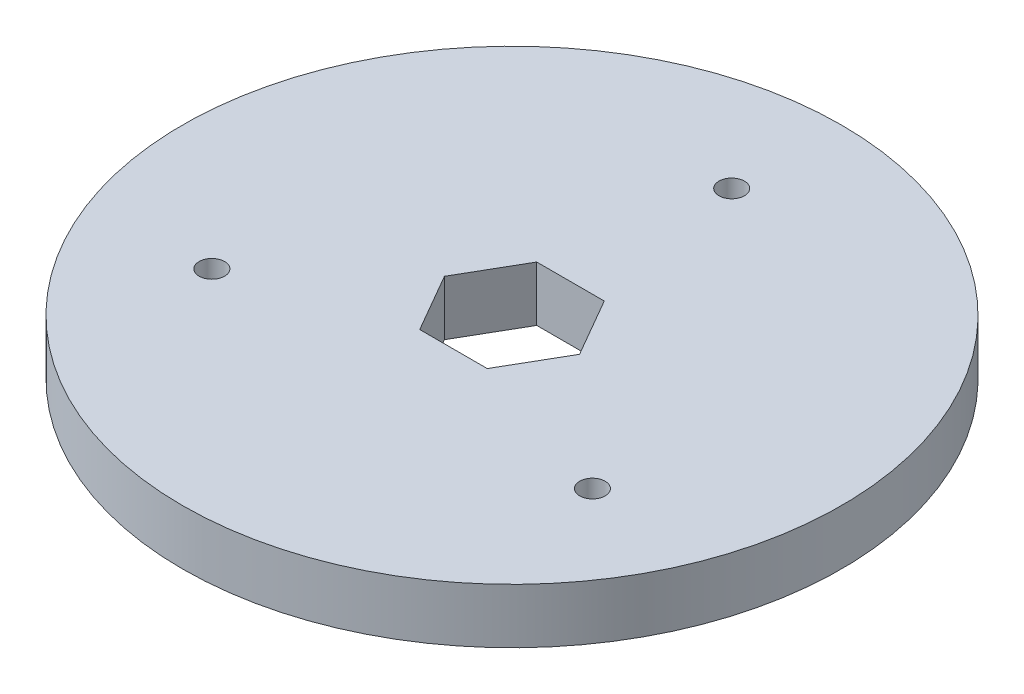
ISO-10303-21;
HEADER;
FILE_DESCRIPTION(('STEP AP214'),'2;1');
FILE_NAME('part.step','',(''),(''),'','','');
FILE_SCHEMA(('AUTOMOTIVE_DESIGN { 1 0 10303 214 1 1 1 1 }'));
ENDSEC;
DATA;
#1=APPLICATION_CONTEXT('core data for automotive mechanical design processes');
#2=APPLICATION_PROTOCOL_DEFINITION('international standard','automotive_design',2000,#1);
#3=PRODUCT_CONTEXT('',#1,'mechanical');
#4=PRODUCT('Part','Part','',(#3));
#5=PRODUCT_RELATED_PRODUCT_CATEGORY('part','',(#4));
#6=PRODUCT_DEFINITION_FORMATION('','',#4);
#7=PRODUCT_DEFINITION_CONTEXT('part definition',#1,'design');
#8=PRODUCT_DEFINITION('design','',#6,#7);
#9=PRODUCT_DEFINITION_SHAPE('','',#8);
#10=(LENGTH_UNIT() NAMED_UNIT(*) SI_UNIT(.MILLI.,.METRE.));
#11=(NAMED_UNIT(*) PLANE_ANGLE_UNIT() SI_UNIT($,.RADIAN.));
#12=(NAMED_UNIT(*) SI_UNIT($,.STERADIAN.) SOLID_ANGLE_UNIT());
#13=UNCERTAINTY_MEASURE_WITH_UNIT(LENGTH_MEASURE(1.E-05),#10,'distance_accuracy_value','');
#14=(GEOMETRIC_REPRESENTATION_CONTEXT(3) GLOBAL_UNCERTAINTY_ASSIGNED_CONTEXT((#13)) GLOBAL_UNIT_ASSIGNED_CONTEXT((#10,
#11,#12)) REPRESENTATION_CONTEXT('',''));
#15=CARTESIAN_POINT('',(0.,0.,0.));
#16=DIRECTION('',(0.,0.,1.));
#17=DIRECTION('',(1.,0.,0.));
#18=AXIS2_PLACEMENT_3D('',#15,#16,#17);
#19=CARTESIAN_POINT('',(0.,6.35,0.));
#20=DIRECTION('',(0.,1.,0.));
#21=DIRECTION('',(0.,0.,1.));
#22=AXIS2_PLACEMENT_3D('',#19,#20,#21);
#23=PLANE('',#22);
#24=CARTESIAN_POINT('',(21.9970452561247,6.35,12.7));
#25=DIRECTION('',(0.,1.,0.));
#26=DIRECTION('',(0.,0.,1.));
#27=AXIS2_PLACEMENT_3D('',#24,#25,#26);
#28=CIRCLE('',#27,1.4732);
#29=CARTESIAN_POINT('',(21.9970452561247,6.35,14.1732));
#30=VERTEX_POINT('',#29);
#31=EDGE_CURVE('E122',#30,#30,#28,.T.);
#32=ORIENTED_EDGE('',*,*,#31,.F.);
#33=EDGE_LOOP('',(#32));
#34=FACE_BOUND('',#33,.T.);
#35=CARTESIAN_POINT('',(0.,6.35,0.));
#36=DIRECTION('',(0.,1.,0.));
#37=DIRECTION('',(0.,0.,1.));
#38=AXIS2_PLACEMENT_3D('',#35,#36,#37);
#39=CIRCLE('',#38,38.1);
#40=CARTESIAN_POINT('',(0.,6.35,38.1));
#41=VERTEX_POINT('',#40);
#42=EDGE_CURVE('E11',#41,#41,#39,.T.);
#43=ORIENTED_EDGE('',*,*,#42,.T.);
#44=EDGE_LOOP('',(#43));
#45=FACE_BOUND('',#44,.T.);
#46=CARTESIAN_POINT('',(0.,6.35,-25.4));
#47=DIRECTION('',(0.,1.,0.));
#48=DIRECTION('',(0.,0.,1.));
#49=AXIS2_PLACEMENT_3D('',#46,#47,#48);
#50=CIRCLE('',#49,1.4732);
#51=CARTESIAN_POINT('',(0.,6.35,-23.9268));
#52=VERTEX_POINT('',#51);
#53=EDGE_CURVE('E142',#52,#52,#50,.T.);
#54=ORIENTED_EDGE('',*,*,#53,.F.);
#55=EDGE_LOOP('',(#54));
#56=FACE_BOUND('',#55,.T.);
#57=DIRECTION('',(-0.5,0.,-0.866025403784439));
#58=VECTOR('',#57,1.);
#59=CARTESIAN_POINT('',(7.80895106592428,6.35,0.));
#60=LINE('',#59,#58);
#61=CARTESIAN_POINT('',(7.80895106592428,6.35,0.));
#62=VERTEX_POINT('',#61);
#63=CARTESIAN_POINT('',(3.90447553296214,6.35,-6.76275));
#64=VERTEX_POINT('',#63);
#65=EDGE_CURVE('E96',#62,#64,#60,.T.);
#66=ORIENTED_EDGE('',*,*,#65,.F.);
#67=DIRECTION('',(0.5,0.,-0.866025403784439));
#68=VECTOR('',#67,1.);
#69=CARTESIAN_POINT('',(3.90447553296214,6.35,6.76275));
#70=LINE('',#69,#68);
#71=CARTESIAN_POINT('',(3.90447553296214,6.35,6.76275));
#72=VERTEX_POINT('',#71);
#73=EDGE_CURVE('E88',#72,#62,#70,.T.);
#74=ORIENTED_EDGE('',*,*,#73,.F.);
#75=DIRECTION('',(1.,0.,0.));
#76=VECTOR('',#75,1.);
#77=CARTESIAN_POINT('',(-3.90447553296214,6.35,6.76275));
#78=LINE('',#77,#76);
#79=CARTESIAN_POINT('',(-3.90447553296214,6.35,6.76275));
#80=VERTEX_POINT('',#79);
#81=EDGE_CURVE('E119',#80,#72,#78,.T.);
#82=ORIENTED_EDGE('',*,*,#81,.F.);
#83=DIRECTION('',(0.5,0.,0.866025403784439));
#84=VECTOR('',#83,1.);
#85=CARTESIAN_POINT('',(-7.80895106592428,6.35,0.));
#86=LINE('',#85,#84);
#87=CARTESIAN_POINT('',(-7.80895106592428,6.35,0.));
#88=VERTEX_POINT('',#87);
#89=EDGE_CURVE('E117',#88,#80,#86,.T.);
#90=ORIENTED_EDGE('',*,*,#89,.F.);
#91=DIRECTION('',(-0.5,0.,0.866025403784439));
#92=VECTOR('',#91,1.);
#93=CARTESIAN_POINT('',(-3.90447553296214,6.35,-6.76275));
#94=LINE('',#93,#92);
#95=CARTESIAN_POINT('',(-3.90447553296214,6.35,-6.76275));
#96=VERTEX_POINT('',#95);
#97=EDGE_CURVE('E112',#96,#88,#94,.T.);
#98=ORIENTED_EDGE('',*,*,#97,.F.);
#99=DIRECTION('',(-1.,0.,0.));
#100=VECTOR('',#99,1.);
#101=CARTESIAN_POINT('',(3.90447553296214,6.35,-6.76275));
#102=LINE('',#101,#100);
#103=EDGE_CURVE('E110',#64,#96,#102,.T.);
#104=ORIENTED_EDGE('',*,*,#103,.F.);
#105=EDGE_LOOP('',(#66,#74,#82,#90,#98,#104));
#106=FACE_BOUND('',#105,.T.);
#107=CARTESIAN_POINT('',(-21.9970452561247,6.35,12.7));
#108=DIRECTION('',(0.,1.,0.));
#109=DIRECTION('',(0.,0.,1.));
#110=AXIS2_PLACEMENT_3D('',#107,#108,#109);
#111=CIRCLE('',#110,1.4732);
#112=CARTESIAN_POINT('',(-21.9970452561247,6.35,14.1732));
#113=VERTEX_POINT('',#112);
#114=EDGE_CURVE('E186',#113,#113,#111,.T.);
#115=ORIENTED_EDGE('',*,*,#114,.F.);
#116=EDGE_LOOP('',(#115));
#117=FACE_BOUND('',#116,.T.);
#118=ADVANCED_FACE('F35',(#34,#45,#56,#106,#117),#23,.T.);
#119=CARTESIAN_POINT('',(0.,0.,0.));
#120=DIRECTION('',(0.,1.,0.));
#121=DIRECTION('',(0.,0.,1.));
#122=AXIS2_PLACEMENT_3D('',#119,#120,#121);
#123=PLANE('',#122);
#124=CARTESIAN_POINT('',(0.,0.,-25.4));
#125=DIRECTION('',(0.,1.,0.));
#126=DIRECTION('',(0.,0.,1.));
#127=AXIS2_PLACEMENT_3D('',#124,#125,#126);
#128=CIRCLE('',#127,1.4732);
#129=CARTESIAN_POINT('',(0.,0.,-23.9268));
#130=VERTEX_POINT('',#129);
#131=EDGE_CURVE('E104',#130,#130,#128,.T.);
#132=ORIENTED_EDGE('',*,*,#131,.T.);
#133=EDGE_LOOP('',(#132));
#134=FACE_BOUND('',#133,.T.);
#135=CARTESIAN_POINT('',(0.,0.,0.));
#136=DIRECTION('',(0.,1.,0.));
#137=DIRECTION('',(0.,0.,1.));
#138=AXIS2_PLACEMENT_3D('',#135,#136,#137);
#139=CIRCLE('',#138,38.1);
#140=CARTESIAN_POINT('',(0.,0.,38.1));
#141=VERTEX_POINT('',#140);
#142=EDGE_CURVE('E39',#141,#141,#139,.T.);
#143=ORIENTED_EDGE('',*,*,#142,.F.);
#144=EDGE_LOOP('',(#143));
#145=FACE_BOUND('',#144,.T.);
#146=DIRECTION('',(0.5,0.,-0.866025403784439));
#147=VECTOR('',#146,1.);
#148=CARTESIAN_POINT('',(3.90447553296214,0.,6.76275));
#149=LINE('',#148,#147);
#150=CARTESIAN_POINT('',(3.90447553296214,0.,6.76275));
#151=VERTEX_POINT('',#150);
#152=CARTESIAN_POINT('',(7.80895106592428,0.,0.));
#153=VERTEX_POINT('',#152);
#154=EDGE_CURVE('E58',#151,#153,#149,.T.);
#155=ORIENTED_EDGE('',*,*,#154,.T.);
#156=DIRECTION('',(-0.5,0.,-0.866025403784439));
#157=VECTOR('',#156,1.);
#158=CARTESIAN_POINT('',(7.80895106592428,0.,0.));
#159=LINE('',#158,#157);
#160=CARTESIAN_POINT('',(3.90447553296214,0.,-6.76275));
#161=VERTEX_POINT('',#160);
#162=EDGE_CURVE('E103',#153,#161,#159,.T.);
#163=ORIENTED_EDGE('',*,*,#162,.T.);
#164=DIRECTION('',(-1.,0.,0.));
#165=VECTOR('',#164,1.);
#166=CARTESIAN_POINT('',(3.90447553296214,0.,-6.76275));
#167=LINE('',#166,#165);
#168=CARTESIAN_POINT('',(-3.90447553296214,0.,-6.76275));
#169=VERTEX_POINT('',#168);
#170=EDGE_CURVE('E124',#161,#169,#167,.T.);
#171=ORIENTED_EDGE('',*,*,#170,.T.);
#172=DIRECTION('',(-0.5,0.,0.866025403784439));
#173=VECTOR('',#172,1.);
#174=CARTESIAN_POINT('',(-3.90447553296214,0.,-6.76275));
#175=LINE('',#174,#173);
#176=CARTESIAN_POINT('',(-7.80895106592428,0.,0.));
#177=VERTEX_POINT('',#176);
#178=EDGE_CURVE('E127',#169,#177,#175,.T.);
#179=ORIENTED_EDGE('',*,*,#178,.T.);
#180=DIRECTION('',(0.5,0.,0.866025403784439));
#181=VECTOR('',#180,1.);
#182=CARTESIAN_POINT('',(-7.80895106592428,0.,0.));
#183=LINE('',#182,#181);
#184=CARTESIAN_POINT('',(-3.90447553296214,0.,6.76275));
#185=VERTEX_POINT('',#184);
#186=EDGE_CURVE('E130',#177,#185,#183,.T.);
#187=ORIENTED_EDGE('',*,*,#186,.T.);
#188=DIRECTION('',(1.,0.,0.));
#189=VECTOR('',#188,1.);
#190=CARTESIAN_POINT('',(-3.90447553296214,0.,6.76275));
#191=LINE('',#190,#189);
#192=EDGE_CURVE('E97',#185,#151,#191,.T.);
#193=ORIENTED_EDGE('',*,*,#192,.T.);
#194=EDGE_LOOP('',(#155,#163,#171,#179,#187,#193));
#195=FACE_BOUND('',#194,.T.);
#196=CARTESIAN_POINT('',(21.9970452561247,0.,12.7));
#197=DIRECTION('',(0.,1.,0.));
#198=DIRECTION('',(0.,0.,1.));
#199=AXIS2_PLACEMENT_3D('',#196,#197,#198);
#200=CIRCLE('',#199,1.4732);
#201=CARTESIAN_POINT('',(21.9970452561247,0.,14.1732));
#202=VERTEX_POINT('',#201);
#203=EDGE_CURVE('E181',#202,#202,#200,.T.);
#204=ORIENTED_EDGE('',*,*,#203,.T.);
#205=EDGE_LOOP('',(#204));
#206=FACE_BOUND('',#205,.T.);
#207=CARTESIAN_POINT('',(-21.9970452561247,0.,12.7));
#208=DIRECTION('',(0.,1.,0.));
#209=DIRECTION('',(0.,0.,1.));
#210=AXIS2_PLACEMENT_3D('',#207,#208,#209);
#211=CIRCLE('',#210,1.4732);
#212=CARTESIAN_POINT('',(-21.9970452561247,0.,14.1732));
#213=VERTEX_POINT('',#212);
#214=EDGE_CURVE('E184',#213,#213,#211,.T.);
#215=ORIENTED_EDGE('',*,*,#214,.T.);
#216=EDGE_LOOP('',(#215));
#217=FACE_BOUND('',#216,.T.);
#218=ADVANCED_FACE('F148',(#134,#145,#195,#206,#217),#123,.F.);
#219=CARTESIAN_POINT('',(0.,6.35,0.));
#220=DIRECTION('',(0.,-1.,0.));
#221=DIRECTION('',(0.,0.,-1.));
#222=AXIS2_PLACEMENT_3D('',#219,#220,#221);
#223=CYLINDRICAL_SURFACE('',#222,38.1);
#224=ORIENTED_EDGE('',*,*,#42,.F.);
#225=EDGE_LOOP('',(#224));
#226=FACE_BOUND('',#225,.T.);
#227=ORIENTED_EDGE('',*,*,#142,.T.);
#228=EDGE_LOOP('',(#227));
#229=FACE_BOUND('',#228,.T.);
#230=ADVANCED_FACE('F37',(#226,#229),#223,.T.);
#231=CARTESIAN_POINT('',(0.,6.35,-25.4));
#232=DIRECTION('',(0.,-1.,0.));
#233=DIRECTION('',(0.,0.,-1.));
#234=AXIS2_PLACEMENT_3D('',#231,#232,#233);
#235=CYLINDRICAL_SURFACE('',#234,1.4732);
#236=ORIENTED_EDGE('',*,*,#53,.T.);
#237=EDGE_LOOP('',(#236));
#238=FACE_BOUND('',#237,.T.);
#239=ORIENTED_EDGE('',*,*,#131,.F.);
#240=EDGE_LOOP('',(#239));
#241=FACE_BOUND('',#240,.T.);
#242=ADVANCED_FACE('F151',(#238,#241),#235,.F.);
#243=CARTESIAN_POINT('',(3.90447553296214,6.35,6.76275));
#244=DIRECTION('',(-0.866025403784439,0.,-0.5));
#245=DIRECTION('',(-0.5,0.,0.866025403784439));
#246=AXIS2_PLACEMENT_3D('',#243,#244,#245);
#247=PLANE('',#246);
#248=ORIENTED_EDGE('',*,*,#154,.F.);
#249=DIRECTION('',(0.,-1.,0.));
#250=VECTOR('',#249,1.);
#251=CARTESIAN_POINT('',(3.90447553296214,6.35,6.76275));
#252=LINE('',#251,#250);
#253=EDGE_CURVE('E92',#72,#151,#252,.T.);
#254=ORIENTED_EDGE('',*,*,#253,.F.);
#255=ORIENTED_EDGE('',*,*,#73,.T.);
#256=DIRECTION('',(0.,-1.,0.));
#257=VECTOR('',#256,1.);
#258=CARTESIAN_POINT('',(7.80895106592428,6.35,0.));
#259=LINE('',#258,#257);
#260=EDGE_CURVE('E91',#62,#153,#259,.T.);
#261=ORIENTED_EDGE('',*,*,#260,.T.);
#262=EDGE_LOOP('',(#248,#254,#255,#261));
#263=FACE_BOUND('',#262,.T.);
#264=ADVANCED_FACE('F90',(#263),#247,.T.);
#265=CARTESIAN_POINT('',(7.80895106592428,6.35,0.));
#266=DIRECTION('',(-0.866025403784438,0.,0.5));
#267=DIRECTION('',(0.5,0.,0.866025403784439));
#268=AXIS2_PLACEMENT_3D('',#265,#266,#267);
#269=PLANE('',#268);
#270=ORIENTED_EDGE('',*,*,#162,.F.);
#271=ORIENTED_EDGE('',*,*,#260,.F.);
#272=ORIENTED_EDGE('',*,*,#65,.T.);
#273=DIRECTION('',(0.,-1.,0.));
#274=VECTOR('',#273,1.);
#275=CARTESIAN_POINT('',(3.90447553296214,6.35,-6.76275));
#276=LINE('',#275,#274);
#277=EDGE_CURVE('E105',#64,#161,#276,.T.);
#278=ORIENTED_EDGE('',*,*,#277,.T.);
#279=EDGE_LOOP('',(#270,#271,#272,#278));
#280=FACE_BOUND('',#279,.T.);
#281=ADVANCED_FACE('F100',(#280),#269,.T.);
#282=CARTESIAN_POINT('',(3.90447553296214,6.35,-6.76275));
#283=DIRECTION('',(0.,0.,1.));
#284=DIRECTION('',(1.,0.,0.));
#285=AXIS2_PLACEMENT_3D('',#282,#283,#284);
#286=PLANE('',#285);
#287=ORIENTED_EDGE('',*,*,#170,.F.);
#288=ORIENTED_EDGE('',*,*,#277,.F.);
#289=ORIENTED_EDGE('',*,*,#103,.T.);
#290=DIRECTION('',(0.,-1.,0.));
#291=VECTOR('',#290,1.);
#292=CARTESIAN_POINT('',(-3.90447553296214,6.35,-6.76275));
#293=LINE('',#292,#291);
#294=EDGE_CURVE('E139',#96,#169,#293,.T.);
#295=ORIENTED_EDGE('',*,*,#294,.T.);
#296=EDGE_LOOP('',(#287,#288,#289,#295));
#297=FACE_BOUND('',#296,.T.);
#298=ADVANCED_FACE('F213',(#297),#286,.T.);
#299=CARTESIAN_POINT('',(-3.90447553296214,6.35,-6.76275));
#300=DIRECTION('',(0.866025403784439,0.,0.5));
#301=DIRECTION('',(0.5,0.,-0.866025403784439));
#302=AXIS2_PLACEMENT_3D('',#299,#300,#301);
#303=PLANE('',#302);
#304=ORIENTED_EDGE('',*,*,#178,.F.);
#305=ORIENTED_EDGE('',*,*,#294,.F.);
#306=ORIENTED_EDGE('',*,*,#97,.T.);
#307=DIRECTION('',(0.,-1.,0.));
#308=VECTOR('',#307,1.);
#309=CARTESIAN_POINT('',(-7.80895106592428,6.35,0.));
#310=LINE('',#309,#308);
#311=EDGE_CURVE('E137',#88,#177,#310,.T.);
#312=ORIENTED_EDGE('',*,*,#311,.T.);
#313=EDGE_LOOP('',(#304,#305,#306,#312));
#314=FACE_BOUND('',#313,.T.);
#315=ADVANCED_FACE('F209',(#314),#303,.T.);
#316=CARTESIAN_POINT('',(-7.80895106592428,6.35,0.));
#317=DIRECTION('',(0.866025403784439,0.,-0.5));
#318=DIRECTION('',(-0.5,0.,-0.866025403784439));
#319=AXIS2_PLACEMENT_3D('',#316,#317,#318);
#320=PLANE('',#319);
#321=ORIENTED_EDGE('',*,*,#186,.F.);
#322=ORIENTED_EDGE('',*,*,#311,.F.);
#323=ORIENTED_EDGE('',*,*,#89,.T.);
#324=DIRECTION('',(0.,-1.,0.));
#325=VECTOR('',#324,1.);
#326=CARTESIAN_POINT('',(-3.90447553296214,6.35,6.76275));
#327=LINE('',#326,#325);
#328=EDGE_CURVE('E50',#80,#185,#327,.T.);
#329=ORIENTED_EDGE('',*,*,#328,.T.);
#330=EDGE_LOOP('',(#321,#322,#323,#329));
#331=FACE_BOUND('',#330,.T.);
#332=ADVANCED_FACE('F204',(#331),#320,.T.);
#333=CARTESIAN_POINT('',(-3.90447553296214,6.35,6.76275));
#334=DIRECTION('',(0.,0.,-1.));
#335=DIRECTION('',(-1.,0.,0.));
#336=AXIS2_PLACEMENT_3D('',#333,#334,#335);
#337=PLANE('',#336);
#338=ORIENTED_EDGE('',*,*,#192,.F.);
#339=ORIENTED_EDGE('',*,*,#328,.F.);
#340=ORIENTED_EDGE('',*,*,#81,.T.);
#341=ORIENTED_EDGE('',*,*,#253,.T.);
#342=EDGE_LOOP('',(#338,#339,#340,#341));
#343=FACE_BOUND('',#342,.T.);
#344=ADVANCED_FACE('F196',(#343),#337,.T.);
#345=CARTESIAN_POINT('',(21.9970452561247,6.35,12.7));
#346=DIRECTION('',(0.,-1.,0.));
#347=DIRECTION('',(0.,0.,-1.));
#348=AXIS2_PLACEMENT_3D('',#345,#346,#347);
#349=CYLINDRICAL_SURFACE('',#348,1.4732);
#350=ORIENTED_EDGE('',*,*,#31,.T.);
#351=EDGE_LOOP('',(#350));
#352=FACE_BOUND('',#351,.T.);
#353=ORIENTED_EDGE('',*,*,#203,.F.);
#354=EDGE_LOOP('',(#353));
#355=FACE_BOUND('',#354,.T.);
#356=ADVANCED_FACE('F192',(#352,#355),#349,.F.);
#357=CARTESIAN_POINT('',(-21.9970452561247,6.35,12.7));
#358=DIRECTION('',(0.,-1.,0.));
#359=DIRECTION('',(0.,0.,-1.));
#360=AXIS2_PLACEMENT_3D('',#357,#358,#359);
#361=CYLINDRICAL_SURFACE('',#360,1.4732);
#362=ORIENTED_EDGE('',*,*,#114,.T.);
#363=EDGE_LOOP('',(#362));
#364=FACE_BOUND('',#363,.T.);
#365=ORIENTED_EDGE('',*,*,#214,.F.);
#366=EDGE_LOOP('',(#365));
#367=FACE_BOUND('',#366,.T.);
#368=ADVANCED_FACE('F195',(#364,#367),#361,.F.);
#369=CLOSED_SHELL('',(#118,#218,#230,#242,#264,#281,#298,#315,#332,#344,#356,#368));
#370=MANIFOLD_SOLID_BREP('B2',#369);
#371=ADVANCED_BREP_SHAPE_REPRESENTATION('',(#18,#370),#14);
#372=SHAPE_DEFINITION_REPRESENTATION(#9,#371);
ENDSEC;
END-ISO-10303-21;
